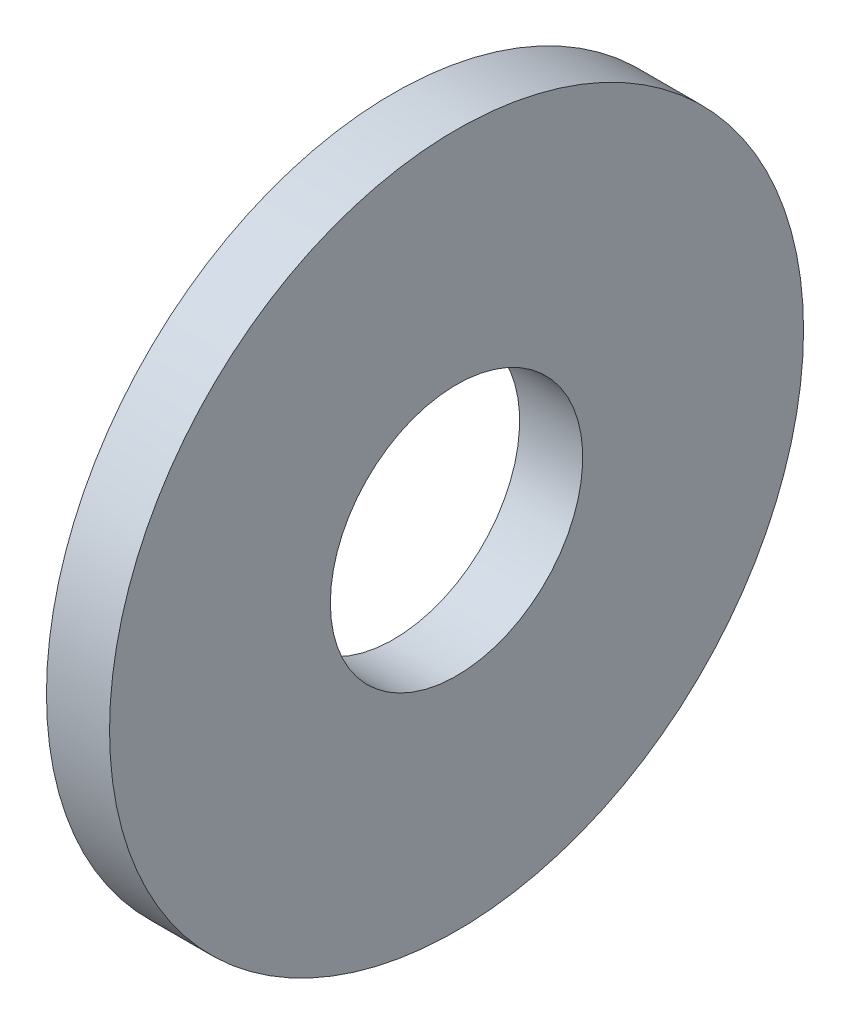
from build123d import *


with BuildPart() as part:
    # Esquisse1 → R_volution1 (revolve)
    with BuildSketch(Plane.XY, mode=Mode.PRIVATE) as r_volution1_sk:
        Polygon((0, 10), (0, 27.5), (-5, 27.5), (-5, 22.5), (-2, 21.5), (-2, 15.5), (-5, 14), (-5, 10), align=None)
    revolve(r_volution1_sk.sketch.rotate(Axis((-20.087077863, 0, 0), (1, 0, 0)), 90), axis=Axis((-20.087077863, 0, 0), (1, 0, 0)))


solid = part.part
